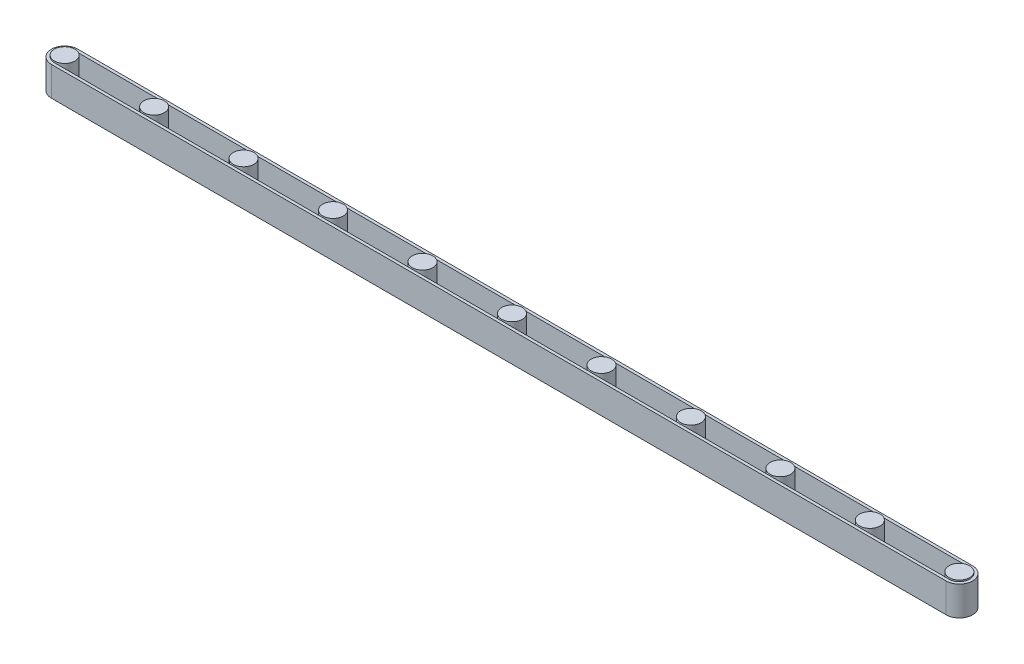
ISO-10303-21;
HEADER;
FILE_DESCRIPTION(('STEP AP214'),'2;1');
FILE_NAME('part.step','',(''),(''),'','','');
FILE_SCHEMA(('AUTOMOTIVE_DESIGN { 1 0 10303 214 1 1 1 1 }'));
ENDSEC;
DATA;
#1=APPLICATION_CONTEXT('core data for automotive mechanical design processes');
#2=APPLICATION_PROTOCOL_DEFINITION('international standard','automotive_design',2000,#1);
#3=PRODUCT_CONTEXT('',#1,'mechanical');
#4=PRODUCT('Part','Part','',(#3));
#5=PRODUCT_RELATED_PRODUCT_CATEGORY('part','',(#4));
#6=PRODUCT_DEFINITION_FORMATION('','',#4);
#7=PRODUCT_DEFINITION_CONTEXT('part definition',#1,'design');
#8=PRODUCT_DEFINITION('design','',#6,#7);
#9=PRODUCT_DEFINITION_SHAPE('','',#8);
#10=(LENGTH_UNIT() NAMED_UNIT(*) SI_UNIT(.MILLI.,.METRE.));
#11=(NAMED_UNIT(*) PLANE_ANGLE_UNIT() SI_UNIT($,.RADIAN.));
#12=(NAMED_UNIT(*) SI_UNIT($,.STERADIAN.) SOLID_ANGLE_UNIT());
#13=UNCERTAINTY_MEASURE_WITH_UNIT(LENGTH_MEASURE(1.E-05),#10,'distance_accuracy_value','');
#14=(GEOMETRIC_REPRESENTATION_CONTEXT(3) GLOBAL_UNCERTAINTY_ASSIGNED_CONTEXT((#13)) GLOBAL_UNIT_ASSIGNED_CONTEXT((#10,
#11,#12)) REPRESENTATION_CONTEXT('',''));
#15=CARTESIAN_POINT('',(0.,0.,0.));
#16=DIRECTION('',(0.,0.,1.));
#17=DIRECTION('',(1.,0.,0.));
#18=AXIS2_PLACEMENT_3D('',#15,#16,#17);
#19=CARTESIAN_POINT('',(0.,50.,0.));
#20=DIRECTION('',(0.,1.,0.));
#21=DIRECTION('',(0.,0.,1.));
#22=AXIS2_PLACEMENT_3D('',#19,#20,#21);
#23=PLANE('',#22);
#24=CARTESIAN_POINT('',(0.,50.,0.));
#25=DIRECTION('',(0.,1.,0.));
#26=DIRECTION('',(0.,0.,1.));
#27=AXIS2_PLACEMENT_3D('',#24,#25,#26);
#28=CIRCLE('',#27,45.);
#29=CARTESIAN_POINT('',(0.,50.,-45.));
#30=VERTEX_POINT('',#29);
#31=CARTESIAN_POINT('',(0.,50.,45.));
#32=VERTEX_POINT('',#31);
#33=EDGE_CURVE('E144',#30,#32,#28,.T.);
#34=ORIENTED_EDGE('',*,*,#33,.T.);
#35=DIRECTION('',(1.,0.,0.));
#36=VECTOR('',#35,1.);
#37=CARTESIAN_POINT('',(0.,50.,45.));
#38=LINE('',#37,#36);
#39=CARTESIAN_POINT('',(3050.,50.,45.0000000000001));
#40=VERTEX_POINT('',#39);
#41=EDGE_CURVE('E147',#32,#40,#38,.T.);
#42=ORIENTED_EDGE('',*,*,#41,.T.);
#43=CARTESIAN_POINT('',(3050.,50.,0.));
#44=DIRECTION('',(0.,1.,0.));
#45=DIRECTION('',(0.,0.,1.));
#46=AXIS2_PLACEMENT_3D('',#43,#44,#45);
#47=CIRCLE('',#46,45.0000000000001);
#48=CARTESIAN_POINT('',(3050.,50.,-45.));
#49=VERTEX_POINT('',#48);
#50=EDGE_CURVE('E150',#40,#49,#47,.T.);
#51=ORIENTED_EDGE('',*,*,#50,.T.);
#52=DIRECTION('',(-1.,0.,0.));
#53=VECTOR('',#52,1.);
#54=CARTESIAN_POINT('',(0.,50.,-45.));
#55=LINE('',#54,#53);
#56=EDGE_CURVE('E152',#49,#30,#55,.T.);
#57=ORIENTED_EDGE('',*,*,#56,.T.);
#58=EDGE_LOOP('',(#34,#42,#51,#57));
#59=FACE_BOUND('',#58,.T.);
#60=DIRECTION('',(1.,0.,0.));
#61=VECTOR('',#60,1.);
#62=CARTESIAN_POINT('',(0.,50.,35.));
#63=LINE('',#62,#61);
#64=CARTESIAN_POINT('',(0.,50.,35.));
#65=VERTEX_POINT('',#64);
#66=CARTESIAN_POINT('',(3050.,50.,35.));
#67=VERTEX_POINT('',#66);
#68=EDGE_CURVE('E116',#65,#67,#63,.T.);
#69=ORIENTED_EDGE('',*,*,#68,.F.);
#70=CARTESIAN_POINT('',(0.,50.,0.));
#71=DIRECTION('',(0.,1.,0.));
#72=DIRECTION('',(0.,0.,1.));
#73=AXIS2_PLACEMENT_3D('',#70,#71,#72);
#74=CIRCLE('',#73,35.);
#75=CARTESIAN_POINT('',(0.,50.,-35.));
#76=VERTEX_POINT('',#75);
#77=EDGE_CURVE('E108',#76,#65,#74,.T.);
#78=ORIENTED_EDGE('',*,*,#77,.F.);
#79=DIRECTION('',(-1.,0.,0.));
#80=VECTOR('',#79,1.);
#81=CARTESIAN_POINT('',(0.,50.,-35.));
#82=LINE('',#81,#80);
#83=CARTESIAN_POINT('',(3050.,50.,-35.));
#84=VERTEX_POINT('',#83);
#85=EDGE_CURVE('E130',#84,#76,#82,.T.);
#86=ORIENTED_EDGE('',*,*,#85,.F.);
#87=CARTESIAN_POINT('',(3050.,50.,0.));
#88=DIRECTION('',(0.,1.,0.));
#89=DIRECTION('',(0.,0.,1.));
#90=AXIS2_PLACEMENT_3D('',#87,#88,#89);
#91=CIRCLE('',#90,35.);
#92=EDGE_CURVE('E128',#67,#84,#91,.T.);
#93=ORIENTED_EDGE('',*,*,#92,.F.);
#94=EDGE_LOOP('',(#69,#78,#86,#93));
#95=FACE_BOUND('',#94,.T.);
#96=ADVANCED_FACE('F43',(#59,#95),#23,.T.);
#97=CARTESIAN_POINT('',(0.,-50.,0.));
#98=DIRECTION('',(0.,1.,0.));
#99=DIRECTION('',(0.,0.,1.));
#100=AXIS2_PLACEMENT_3D('',#97,#98,#99);
#101=PLANE('',#100);
#102=CARTESIAN_POINT('',(0.,-50.,0.));
#103=DIRECTION('',(0.,1.,0.));
#104=DIRECTION('',(0.,0.,1.));
#105=AXIS2_PLACEMENT_3D('',#102,#103,#104);
#106=CIRCLE('',#105,45.);
#107=CARTESIAN_POINT('',(0.,-50.,-45.));
#108=VERTEX_POINT('',#107);
#109=CARTESIAN_POINT('',(0.,-50.,45.));
#110=VERTEX_POINT('',#109);
#111=EDGE_CURVE('E124',#108,#110,#106,.T.);
#112=ORIENTED_EDGE('',*,*,#111,.F.);
#113=DIRECTION('',(-1.,0.,0.));
#114=VECTOR('',#113,1.);
#115=CARTESIAN_POINT('',(0.,-50.,-45.));
#116=LINE('',#115,#114);
#117=CARTESIAN_POINT('',(3050.,-50.,-45.));
#118=VERTEX_POINT('',#117);
#119=EDGE_CURVE('E148',#118,#108,#116,.T.);
#120=ORIENTED_EDGE('',*,*,#119,.F.);
#121=CARTESIAN_POINT('',(3050.,-50.,0.));
#122=DIRECTION('',(0.,1.,0.));
#123=DIRECTION('',(0.,0.,1.));
#124=AXIS2_PLACEMENT_3D('',#121,#122,#123);
#125=CIRCLE('',#124,45.0000000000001);
#126=CARTESIAN_POINT('',(3050.,-50.,45.0000000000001));
#127=VERTEX_POINT('',#126);
#128=EDGE_CURVE('E159',#127,#118,#125,.T.);
#129=ORIENTED_EDGE('',*,*,#128,.F.);
#130=DIRECTION('',(1.,0.,0.));
#131=VECTOR('',#130,1.);
#132=CARTESIAN_POINT('',(0.,-50.,45.));
#133=LINE('',#132,#131);
#134=EDGE_CURVE('E157',#110,#127,#133,.T.);
#135=ORIENTED_EDGE('',*,*,#134,.F.);
#136=EDGE_LOOP('',(#112,#120,#129,#135));
#137=FACE_BOUND('',#136,.T.);
#138=CARTESIAN_POINT('',(0.,-50.,0.));
#139=DIRECTION('',(0.,1.,0.));
#140=DIRECTION('',(0.,0.,1.));
#141=AXIS2_PLACEMENT_3D('',#138,#139,#140);
#142=CIRCLE('',#141,35.);
#143=CARTESIAN_POINT('',(0.,-50.,-35.));
#144=VERTEX_POINT('',#143);
#145=CARTESIAN_POINT('',(0.,-50.,35.));
#146=VERTEX_POINT('',#145);
#147=EDGE_CURVE('E66',#144,#146,#142,.T.);
#148=ORIENTED_EDGE('',*,*,#147,.T.);
#149=DIRECTION('',(1.,0.,0.));
#150=VECTOR('',#149,1.);
#151=CARTESIAN_POINT('',(0.,-50.,35.));
#152=LINE('',#151,#150);
#153=CARTESIAN_POINT('',(3050.,-50.,35.));
#154=VERTEX_POINT('',#153);
#155=EDGE_CURVE('E123',#146,#154,#152,.T.);
#156=ORIENTED_EDGE('',*,*,#155,.T.);
#157=CARTESIAN_POINT('',(3050.,-50.,0.));
#158=DIRECTION('',(0.,1.,0.));
#159=DIRECTION('',(0.,0.,1.));
#160=AXIS2_PLACEMENT_3D('',#157,#158,#159);
#161=CIRCLE('',#160,35.);
#162=CARTESIAN_POINT('',(3050.,-50.,-35.));
#163=VERTEX_POINT('',#162);
#164=EDGE_CURVE('E136',#154,#163,#161,.T.);
#165=ORIENTED_EDGE('',*,*,#164,.T.);
#166=DIRECTION('',(-1.,0.,0.));
#167=VECTOR('',#166,1.);
#168=CARTESIAN_POINT('',(0.,-50.,-35.));
#169=LINE('',#168,#167);
#170=EDGE_CURVE('E117',#163,#144,#169,.T.);
#171=ORIENTED_EDGE('',*,*,#170,.T.);
#172=EDGE_LOOP('',(#148,#156,#165,#171));
#173=FACE_BOUND('',#172,.T.);
#174=ADVANCED_FACE('F177',(#137,#173),#101,.F.);
#175=CARTESIAN_POINT('',(0.,50.,0.));
#176=DIRECTION('',(0.,-1.,0.));
#177=DIRECTION('',(0.,0.,-1.));
#178=AXIS2_PLACEMENT_3D('',#175,#176,#177);
#179=CYLINDRICAL_SURFACE('',#178,45.);
#180=ORIENTED_EDGE('',*,*,#111,.T.);
#181=DIRECTION('',(0.,-1.,0.));
#182=VECTOR('',#181,1.);
#183=CARTESIAN_POINT('',(0.,50.,45.));
#184=LINE('',#183,#182);
#185=EDGE_CURVE('E12',#32,#110,#184,.T.);
#186=ORIENTED_EDGE('',*,*,#185,.F.);
#187=ORIENTED_EDGE('',*,*,#33,.F.);
#188=DIRECTION('',(0.,-1.,0.));
#189=VECTOR('',#188,1.);
#190=CARTESIAN_POINT('',(0.,50.,-45.));
#191=LINE('',#190,#189);
#192=EDGE_CURVE('E154',#30,#108,#191,.T.);
#193=ORIENTED_EDGE('',*,*,#192,.T.);
#194=EDGE_LOOP('',(#180,#186,#187,#193));
#195=FACE_BOUND('',#194,.T.);
#196=ADVANCED_FACE('F45',(#195),#179,.T.);
#197=CARTESIAN_POINT('',(0.,50.,45.));
#198=DIRECTION('',(0.,0.,-1.));
#199=DIRECTION('',(-1.,0.,0.));
#200=AXIS2_PLACEMENT_3D('',#197,#198,#199);
#201=PLANE('',#200);
#202=ORIENTED_EDGE('',*,*,#134,.T.);
#203=DIRECTION('',(0.,-1.,0.));
#204=VECTOR('',#203,1.);
#205=CARTESIAN_POINT('',(3050.,50.,45.0000000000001));
#206=LINE('',#205,#204);
#207=EDGE_CURVE('E51',#40,#127,#206,.T.);
#208=ORIENTED_EDGE('',*,*,#207,.F.);
#209=ORIENTED_EDGE('',*,*,#41,.F.);
#210=ORIENTED_EDGE('',*,*,#185,.T.);
#211=EDGE_LOOP('',(#202,#208,#209,#210));
#212=FACE_BOUND('',#211,.T.);
#213=ADVANCED_FACE('F187',(#212),#201,.F.);
#214=CARTESIAN_POINT('',(3050.,50.,0.));
#215=DIRECTION('',(0.,-1.,0.));
#216=DIRECTION('',(0.,0.,-1.));
#217=AXIS2_PLACEMENT_3D('',#214,#215,#216);
#218=CYLINDRICAL_SURFACE('',#217,45.0000000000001);
#219=ORIENTED_EDGE('',*,*,#128,.T.);
#220=DIRECTION('',(0.,-1.,0.));
#221=VECTOR('',#220,1.);
#222=CARTESIAN_POINT('',(3050.,50.,-45.));
#223=LINE('',#222,#221);
#224=EDGE_CURVE('E164',#49,#118,#223,.T.);
#225=ORIENTED_EDGE('',*,*,#224,.F.);
#226=ORIENTED_EDGE('',*,*,#50,.F.);
#227=ORIENTED_EDGE('',*,*,#207,.T.);
#228=EDGE_LOOP('',(#219,#225,#226,#227));
#229=FACE_BOUND('',#228,.T.);
#230=ADVANCED_FACE('F171',(#229),#218,.T.);
#231=CARTESIAN_POINT('',(0.,50.,-45.));
#232=DIRECTION('',(0.,0.,1.));
#233=DIRECTION('',(1.,0.,0.));
#234=AXIS2_PLACEMENT_3D('',#231,#232,#233);
#235=PLANE('',#234);
#236=ORIENTED_EDGE('',*,*,#119,.T.);
#237=ORIENTED_EDGE('',*,*,#192,.F.);
#238=ORIENTED_EDGE('',*,*,#56,.F.);
#239=ORIENTED_EDGE('',*,*,#224,.T.);
#240=EDGE_LOOP('',(#236,#237,#238,#239));
#241=FACE_BOUND('',#240,.T.);
#242=ADVANCED_FACE('F181',(#241),#235,.F.);
#243=CARTESIAN_POINT('',(0.,50.,0.));
#244=DIRECTION('',(0.,-1.,0.));
#245=DIRECTION('',(0.,0.,-1.));
#246=AXIS2_PLACEMENT_3D('',#243,#244,#245);
#247=CYLINDRICAL_SURFACE('',#246,35.);
#248=ORIENTED_EDGE('',*,*,#147,.F.);
#249=DIRECTION('',(0.,-1.,0.));
#250=VECTOR('',#249,1.);
#251=CARTESIAN_POINT('',(0.,50.,-35.));
#252=LINE('',#251,#250);
#253=EDGE_CURVE('E112',#76,#144,#252,.T.);
#254=ORIENTED_EDGE('',*,*,#253,.F.);
#255=ORIENTED_EDGE('',*,*,#77,.T.);
#256=DIRECTION('',(0.,-1.,0.));
#257=VECTOR('',#256,1.);
#258=CARTESIAN_POINT('',(0.,50.,35.));
#259=LINE('',#258,#257);
#260=EDGE_CURVE('E111',#65,#146,#259,.T.);
#261=ORIENTED_EDGE('',*,*,#260,.T.);
#262=EDGE_LOOP('',(#248,#254,#255,#261));
#263=FACE_BOUND('',#262,.T.);
#264=ADVANCED_FACE('F110',(#263),#247,.F.);
#265=CARTESIAN_POINT('',(0.,50.,35.));
#266=DIRECTION('',(0.,0.,-1.));
#267=DIRECTION('',(-1.,0.,0.));
#268=AXIS2_PLACEMENT_3D('',#265,#266,#267);
#269=PLANE('',#268);
#270=ORIENTED_EDGE('',*,*,#155,.F.);
#271=ORIENTED_EDGE('',*,*,#260,.F.);
#272=ORIENTED_EDGE('',*,*,#68,.T.);
#273=DIRECTION('',(0.,-1.,0.));
#274=VECTOR('',#273,1.);
#275=CARTESIAN_POINT('',(3050.,50.,35.));
#276=LINE('',#275,#274);
#277=EDGE_CURVE('E125',#67,#154,#276,.T.);
#278=ORIENTED_EDGE('',*,*,#277,.T.);
#279=EDGE_LOOP('',(#270,#271,#272,#278));
#280=FACE_BOUND('',#279,.T.);
#281=ADVANCED_FACE('F120',(#280),#269,.T.);
#282=CARTESIAN_POINT('',(3050.,50.,0.));
#283=DIRECTION('',(0.,-1.,0.));
#284=DIRECTION('',(0.,0.,-1.));
#285=AXIS2_PLACEMENT_3D('',#282,#283,#284);
#286=CYLINDRICAL_SURFACE('',#285,35.);
#287=ORIENTED_EDGE('',*,*,#164,.F.);
#288=ORIENTED_EDGE('',*,*,#277,.F.);
#289=ORIENTED_EDGE('',*,*,#92,.T.);
#290=DIRECTION('',(0.,-1.,0.));
#291=VECTOR('',#290,1.);
#292=CARTESIAN_POINT('',(3050.,50.,-35.));
#293=LINE('',#292,#291);
#294=EDGE_CURVE('E58',#84,#163,#293,.T.);
#295=ORIENTED_EDGE('',*,*,#294,.T.);
#296=EDGE_LOOP('',(#287,#288,#289,#295));
#297=FACE_BOUND('',#296,.T.);
#298=ADVANCED_FACE('F210',(#297),#286,.F.);
#299=CARTESIAN_POINT('',(0.,50.,-35.));
#300=DIRECTION('',(0.,0.,1.));
#301=DIRECTION('',(1.,0.,0.));
#302=AXIS2_PLACEMENT_3D('',#299,#300,#301);
#303=PLANE('',#302);
#304=ORIENTED_EDGE('',*,*,#170,.F.);
#305=ORIENTED_EDGE('',*,*,#294,.F.);
#306=ORIENTED_EDGE('',*,*,#85,.T.);
#307=ORIENTED_EDGE('',*,*,#253,.T.);
#308=EDGE_LOOP('',(#304,#305,#306,#307));
#309=FACE_BOUND('',#308,.T.);
#310=ADVANCED_FACE('F214',(#309),#303,.T.);
#311=CLOSED_SHELL('',(#96,#174,#196,#213,#230,#242,#264,#281,#298,#310));
#312=MANIFOLD_SOLID_BREP('B2',#311);
#313=CARTESIAN_POINT('',(2745.,55.,0.));
#314=DIRECTION('',(0.,-1.,0.));
#315=DIRECTION('',(0.,0.,-1.));
#316=AXIS2_PLACEMENT_3D('',#313,#314,#315);
#317=CYLINDRICAL_SURFACE('',#316,35.0000000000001);
#318=CARTESIAN_POINT('',(2745.,55.,0.));
#319=DIRECTION('',(0.,1.,0.));
#320=DIRECTION('',(0.,0.,1.));
#321=AXIS2_PLACEMENT_3D('',#318,#319,#320);
#322=CIRCLE('',#321,35.0000000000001);
#323=CARTESIAN_POINT('',(2745.,55.,35.0000000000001));
#324=VERTEX_POINT('',#323);
#325=EDGE_CURVE('E42',#324,#324,#322,.T.);
#326=ORIENTED_EDGE('',*,*,#325,.F.);
#327=EDGE_LOOP('',(#326));
#328=FACE_BOUND('',#327,.T.);
#329=CARTESIAN_POINT('',(2745.,-55.,0.));
#330=DIRECTION('',(0.,1.,0.));
#331=DIRECTION('',(0.,0.,1.));
#332=AXIS2_PLACEMENT_3D('',#329,#330,#331);
#333=CIRCLE('',#332,35.0000000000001);
#334=CARTESIAN_POINT('',(2745.,-55.,35.0000000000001));
#335=VERTEX_POINT('',#334);
#336=EDGE_CURVE('E283',#335,#335,#333,.T.);
#337=ORIENTED_EDGE('',*,*,#336,.T.);
#338=EDGE_LOOP('',(#337));
#339=FACE_BOUND('',#338,.T.);
#340=ADVANCED_FACE('F280',(#328,#339),#317,.T.);
#341=CARTESIAN_POINT('',(2745.,55.,0.));
#342=DIRECTION('',(0.,1.,0.));
#343=DIRECTION('',(0.,0.,1.));
#344=AXIS2_PLACEMENT_3D('',#341,#342,#343);
#345=PLANE('',#344);
#346=ORIENTED_EDGE('',*,*,#325,.T.);
#347=EDGE_LOOP('',(#346));
#348=FACE_BOUND('',#347,.T.);
#349=ADVANCED_FACE('F295',(#348),#345,.T.);
#350=CARTESIAN_POINT('',(2745.,-55.,0.));
#351=DIRECTION('',(0.,1.,0.));
#352=DIRECTION('',(0.,0.,1.));
#353=AXIS2_PLACEMENT_3D('',#350,#351,#352);
#354=PLANE('',#353);
#355=ORIENTED_EDGE('',*,*,#336,.F.);
#356=EDGE_LOOP('',(#355));
#357=FACE_BOUND('',#356,.T.);
#358=ADVANCED_FACE('F293',(#357),#354,.F.);
#359=CLOSED_SHELL('',(#340,#349,#358));
#360=MANIFOLD_SOLID_BREP('B6',#359);
#361=CARTESIAN_POINT('',(2440.,55.,0.));
#362=DIRECTION('',(0.,-1.,0.));
#363=DIRECTION('',(0.,0.,-1.));
#364=AXIS2_PLACEMENT_3D('',#361,#362,#363);
#365=CYLINDRICAL_SURFACE('',#364,35.0000000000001);
#366=CARTESIAN_POINT('',(2440.,55.,0.));
#367=DIRECTION('',(0.,1.,0.));
#368=DIRECTION('',(0.,0.,1.));
#369=AXIS2_PLACEMENT_3D('',#366,#367,#368);
#370=CIRCLE('',#369,35.0000000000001);
#371=CARTESIAN_POINT('',(2440.,55.,35.0000000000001));
#372=VERTEX_POINT('',#371);
#373=EDGE_CURVE('E279',#372,#372,#370,.T.);
#374=ORIENTED_EDGE('',*,*,#373,.F.);
#375=EDGE_LOOP('',(#374));
#376=FACE_BOUND('',#375,.T.);
#377=CARTESIAN_POINT('',(2440.,-55.,0.));
#378=DIRECTION('',(0.,1.,0.));
#379=DIRECTION('',(0.,0.,1.));
#380=AXIS2_PLACEMENT_3D('',#377,#378,#379);
#381=CIRCLE('',#380,35.0000000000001);
#382=CARTESIAN_POINT('',(2440.,-55.,35.0000000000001));
#383=VERTEX_POINT('',#382);
#384=EDGE_CURVE('E331',#383,#383,#381,.T.);
#385=ORIENTED_EDGE('',*,*,#384,.T.);
#386=EDGE_LOOP('',(#385));
#387=FACE_BOUND('',#386,.T.);
#388=ADVANCED_FACE('F328',(#376,#387),#365,.T.);
#389=CARTESIAN_POINT('',(2440.,55.,0.));
#390=DIRECTION('',(0.,1.,0.));
#391=DIRECTION('',(0.,0.,1.));
#392=AXIS2_PLACEMENT_3D('',#389,#390,#391);
#393=PLANE('',#392);
#394=ORIENTED_EDGE('',*,*,#373,.T.);
#395=EDGE_LOOP('',(#394));
#396=FACE_BOUND('',#395,.T.);
#397=ADVANCED_FACE('F343',(#396),#393,.T.);
#398=CARTESIAN_POINT('',(2440.,-55.,0.));
#399=DIRECTION('',(0.,1.,0.));
#400=DIRECTION('',(0.,0.,1.));
#401=AXIS2_PLACEMENT_3D('',#398,#399,#400);
#402=PLANE('',#401);
#403=ORIENTED_EDGE('',*,*,#384,.F.);
#404=EDGE_LOOP('',(#403));
#405=FACE_BOUND('',#404,.T.);
#406=ADVANCED_FACE('F341',(#405),#402,.F.);
#407=CLOSED_SHELL('',(#388,#397,#406));
#408=MANIFOLD_SOLID_BREP('B37',#407);
#409=CARTESIAN_POINT('',(2135.,55.,0.));
#410=DIRECTION('',(0.,-1.,0.));
#411=DIRECTION('',(0.,0.,-1.));
#412=AXIS2_PLACEMENT_3D('',#409,#410,#411);
#413=CYLINDRICAL_SURFACE('',#412,35.0000000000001);
#414=CARTESIAN_POINT('',(2135.,55.,0.));
#415=DIRECTION('',(0.,1.,0.));
#416=DIRECTION('',(0.,0.,1.));
#417=AXIS2_PLACEMENT_3D('',#414,#415,#416);
#418=CIRCLE('',#417,35.0000000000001);
#419=CARTESIAN_POINT('',(2135.,55.,35.0000000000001));
#420=VERTEX_POINT('',#419);
#421=EDGE_CURVE('E327',#420,#420,#418,.T.);
#422=ORIENTED_EDGE('',*,*,#421,.F.);
#423=EDGE_LOOP('',(#422));
#424=FACE_BOUND('',#423,.T.);
#425=CARTESIAN_POINT('',(2135.,-55.,0.));
#426=DIRECTION('',(0.,1.,0.));
#427=DIRECTION('',(0.,0.,1.));
#428=AXIS2_PLACEMENT_3D('',#425,#426,#427);
#429=CIRCLE('',#428,35.0000000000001);
#430=CARTESIAN_POINT('',(2135.,-55.,35.0000000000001));
#431=VERTEX_POINT('',#430);
#432=EDGE_CURVE('E379',#431,#431,#429,.T.);
#433=ORIENTED_EDGE('',*,*,#432,.T.);
#434=EDGE_LOOP('',(#433));
#435=FACE_BOUND('',#434,.T.);
#436=ADVANCED_FACE('F376',(#424,#435),#413,.T.);
#437=CARTESIAN_POINT('',(2135.,55.,0.));
#438=DIRECTION('',(0.,1.,0.));
#439=DIRECTION('',(0.,0.,1.));
#440=AXIS2_PLACEMENT_3D('',#437,#438,#439);
#441=PLANE('',#440);
#442=ORIENTED_EDGE('',*,*,#421,.T.);
#443=EDGE_LOOP('',(#442));
#444=FACE_BOUND('',#443,.T.);
#445=ADVANCED_FACE('F391',(#444),#441,.T.);
#446=CARTESIAN_POINT('',(2135.,-55.,0.));
#447=DIRECTION('',(0.,1.,0.));
#448=DIRECTION('',(0.,0.,1.));
#449=AXIS2_PLACEMENT_3D('',#446,#447,#448);
#450=PLANE('',#449);
#451=ORIENTED_EDGE('',*,*,#432,.F.);
#452=EDGE_LOOP('',(#451));
#453=FACE_BOUND('',#452,.T.);
#454=ADVANCED_FACE('F389',(#453),#450,.F.);
#455=CLOSED_SHELL('',(#436,#445,#454));
#456=MANIFOLD_SOLID_BREP('B274',#455);
#457=CARTESIAN_POINT('',(1525.,55.,0.));
#458=DIRECTION('',(0.,-1.,0.));
#459=DIRECTION('',(0.,0.,-1.));
#460=AXIS2_PLACEMENT_3D('',#457,#458,#459);
#461=CYLINDRICAL_SURFACE('',#460,34.9999999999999);
#462=CARTESIAN_POINT('',(1525.,55.,0.));
#463=DIRECTION('',(0.,1.,0.));
#464=DIRECTION('',(0.,0.,1.));
#465=AXIS2_PLACEMENT_3D('',#462,#463,#464);
#466=CIRCLE('',#465,34.9999999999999);
#467=CARTESIAN_POINT('',(1525.,55.,34.9999999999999));
#468=VERTEX_POINT('',#467);
#469=EDGE_CURVE('E375',#468,#468,#466,.T.);
#470=ORIENTED_EDGE('',*,*,#469,.F.);
#471=EDGE_LOOP('',(#470));
#472=FACE_BOUND('',#471,.T.);
#473=CARTESIAN_POINT('',(1525.,-55.,0.));
#474=DIRECTION('',(0.,1.,0.));
#475=DIRECTION('',(0.,0.,1.));
#476=AXIS2_PLACEMENT_3D('',#473,#474,#475);
#477=CIRCLE('',#476,34.9999999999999);
#478=CARTESIAN_POINT('',(1525.,-55.,34.9999999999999));
#479=VERTEX_POINT('',#478);
#480=EDGE_CURVE('E427',#479,#479,#477,.T.);
#481=ORIENTED_EDGE('',*,*,#480,.T.);
#482=EDGE_LOOP('',(#481));
#483=FACE_BOUND('',#482,.T.);
#484=ADVANCED_FACE('F424',(#472,#483),#461,.T.);
#485=CARTESIAN_POINT('',(1525.,55.,0.));
#486=DIRECTION('',(0.,1.,0.));
#487=DIRECTION('',(0.,0.,1.));
#488=AXIS2_PLACEMENT_3D('',#485,#486,#487);
#489=PLANE('',#488);
#490=ORIENTED_EDGE('',*,*,#469,.T.);
#491=EDGE_LOOP('',(#490));
#492=FACE_BOUND('',#491,.T.);
#493=ADVANCED_FACE('F439',(#492),#489,.T.);
#494=CARTESIAN_POINT('',(1525.,-55.,0.));
#495=DIRECTION('',(0.,1.,0.));
#496=DIRECTION('',(0.,0.,1.));
#497=AXIS2_PLACEMENT_3D('',#494,#495,#496);
#498=PLANE('',#497);
#499=ORIENTED_EDGE('',*,*,#480,.F.);
#500=EDGE_LOOP('',(#499));
#501=FACE_BOUND('',#500,.T.);
#502=ADVANCED_FACE('F437',(#501),#498,.F.);
#503=CLOSED_SHELL('',(#484,#493,#502));
#504=MANIFOLD_SOLID_BREP('B322',#503);
#505=CARTESIAN_POINT('',(1830.,55.,0.));
#506=DIRECTION('',(0.,-1.,0.));
#507=DIRECTION('',(0.,0.,-1.));
#508=AXIS2_PLACEMENT_3D('',#505,#506,#507);
#509=CYLINDRICAL_SURFACE('',#508,35.0000000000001);
#510=CARTESIAN_POINT('',(1830.,55.,0.));
#511=DIRECTION('',(0.,1.,0.));
#512=DIRECTION('',(0.,0.,1.));
#513=AXIS2_PLACEMENT_3D('',#510,#511,#512);
#514=CIRCLE('',#513,35.0000000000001);
#515=CARTESIAN_POINT('',(1830.,55.,35.0000000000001));
#516=VERTEX_POINT('',#515);
#517=EDGE_CURVE('E423',#516,#516,#514,.T.);
#518=ORIENTED_EDGE('',*,*,#517,.F.);
#519=EDGE_LOOP('',(#518));
#520=FACE_BOUND('',#519,.T.);
#521=CARTESIAN_POINT('',(1830.,-55.,0.));
#522=DIRECTION('',(0.,1.,0.));
#523=DIRECTION('',(0.,0.,1.));
#524=AXIS2_PLACEMENT_3D('',#521,#522,#523);
#525=CIRCLE('',#524,35.0000000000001);
#526=CARTESIAN_POINT('',(1830.,-55.,35.0000000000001));
#527=VERTEX_POINT('',#526);
#528=EDGE_CURVE('E475',#527,#527,#525,.T.);
#529=ORIENTED_EDGE('',*,*,#528,.T.);
#530=EDGE_LOOP('',(#529));
#531=FACE_BOUND('',#530,.T.);
#532=ADVANCED_FACE('F472',(#520,#531),#509,.T.);
#533=CARTESIAN_POINT('',(1830.,55.,0.));
#534=DIRECTION('',(0.,1.,0.));
#535=DIRECTION('',(0.,0.,1.));
#536=AXIS2_PLACEMENT_3D('',#533,#534,#535);
#537=PLANE('',#536);
#538=ORIENTED_EDGE('',*,*,#517,.T.);
#539=EDGE_LOOP('',(#538));
#540=FACE_BOUND('',#539,.T.);
#541=ADVANCED_FACE('F487',(#540),#537,.T.);
#542=CARTESIAN_POINT('',(1830.,-55.,0.));
#543=DIRECTION('',(0.,1.,0.));
#544=DIRECTION('',(0.,0.,1.));
#545=AXIS2_PLACEMENT_3D('',#542,#543,#544);
#546=PLANE('',#545);
#547=ORIENTED_EDGE('',*,*,#528,.F.);
#548=EDGE_LOOP('',(#547));
#549=FACE_BOUND('',#548,.T.);
#550=ADVANCED_FACE('F485',(#549),#546,.F.);
#551=CLOSED_SHELL('',(#532,#541,#550));
#552=MANIFOLD_SOLID_BREP('B370',#551);
#553=CARTESIAN_POINT('',(1220.,55.,0.));
#554=DIRECTION('',(0.,-1.,0.));
#555=DIRECTION('',(0.,0.,-1.));
#556=AXIS2_PLACEMENT_3D('',#553,#554,#555);
#557=CYLINDRICAL_SURFACE('',#556,34.9999999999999);
#558=CARTESIAN_POINT('',(1220.,55.,0.));
#559=DIRECTION('',(0.,1.,0.));
#560=DIRECTION('',(0.,0.,1.));
#561=AXIS2_PLACEMENT_3D('',#558,#559,#560);
#562=CIRCLE('',#561,34.9999999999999);
#563=CARTESIAN_POINT('',(1220.,55.,34.9999999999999));
#564=VERTEX_POINT('',#563);
#565=EDGE_CURVE('E471',#564,#564,#562,.T.);
#566=ORIENTED_EDGE('',*,*,#565,.F.);
#567=EDGE_LOOP('',(#566));
#568=FACE_BOUND('',#567,.T.);
#569=CARTESIAN_POINT('',(1220.,-55.,0.));
#570=DIRECTION('',(0.,1.,0.));
#571=DIRECTION('',(0.,0.,1.));
#572=AXIS2_PLACEMENT_3D('',#569,#570,#571);
#573=CIRCLE('',#572,34.9999999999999);
#574=CARTESIAN_POINT('',(1220.,-55.,34.9999999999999));
#575=VERTEX_POINT('',#574);
#576=EDGE_CURVE('E523',#575,#575,#573,.T.);
#577=ORIENTED_EDGE('',*,*,#576,.T.);
#578=EDGE_LOOP('',(#577));
#579=FACE_BOUND('',#578,.T.);
#580=ADVANCED_FACE('F520',(#568,#579),#557,.T.);
#581=CARTESIAN_POINT('',(1220.,55.,0.));
#582=DIRECTION('',(0.,1.,0.));
#583=DIRECTION('',(0.,0.,1.));
#584=AXIS2_PLACEMENT_3D('',#581,#582,#583);
#585=PLANE('',#584);
#586=ORIENTED_EDGE('',*,*,#565,.T.);
#587=EDGE_LOOP('',(#586));
#588=FACE_BOUND('',#587,.T.);
#589=ADVANCED_FACE('F535',(#588),#585,.T.);
#590=CARTESIAN_POINT('',(1220.,-55.,0.));
#591=DIRECTION('',(0.,1.,0.));
#592=DIRECTION('',(0.,0.,1.));
#593=AXIS2_PLACEMENT_3D('',#590,#591,#592);
#594=PLANE('',#593);
#595=ORIENTED_EDGE('',*,*,#576,.F.);
#596=EDGE_LOOP('',(#595));
#597=FACE_BOUND('',#596,.T.);
#598=ADVANCED_FACE('F533',(#597),#594,.F.);
#599=CLOSED_SHELL('',(#580,#589,#598));
#600=MANIFOLD_SOLID_BREP('B418',#599);
#601=CARTESIAN_POINT('',(915.,55.,0.));
#602=DIRECTION('',(0.,-1.,0.));
#603=DIRECTION('',(0.,0.,-1.));
#604=AXIS2_PLACEMENT_3D('',#601,#602,#603);
#605=CYLINDRICAL_SURFACE('',#604,34.9999999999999);
#606=CARTESIAN_POINT('',(915.,55.,0.));
#607=DIRECTION('',(0.,1.,0.));
#608=DIRECTION('',(0.,0.,1.));
#609=AXIS2_PLACEMENT_3D('',#606,#607,#608);
#610=CIRCLE('',#609,34.9999999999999);
#611=CARTESIAN_POINT('',(915.,55.,34.9999999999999));
#612=VERTEX_POINT('',#611);
#613=EDGE_CURVE('E519',#612,#612,#610,.T.);
#614=ORIENTED_EDGE('',*,*,#613,.F.);
#615=EDGE_LOOP('',(#614));
#616=FACE_BOUND('',#615,.T.);
#617=CARTESIAN_POINT('',(915.,-55.,0.));
#618=DIRECTION('',(0.,1.,0.));
#619=DIRECTION('',(0.,0.,1.));
#620=AXIS2_PLACEMENT_3D('',#617,#618,#619);
#621=CIRCLE('',#620,34.9999999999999);
#622=CARTESIAN_POINT('',(915.,-55.,34.9999999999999));
#623=VERTEX_POINT('',#622);
#624=EDGE_CURVE('E571',#623,#623,#621,.T.);
#625=ORIENTED_EDGE('',*,*,#624,.T.);
#626=EDGE_LOOP('',(#625));
#627=FACE_BOUND('',#626,.T.);
#628=ADVANCED_FACE('F568',(#616,#627),#605,.T.);
#629=CARTESIAN_POINT('',(915.,55.,0.));
#630=DIRECTION('',(0.,1.,0.));
#631=DIRECTION('',(0.,0.,1.));
#632=AXIS2_PLACEMENT_3D('',#629,#630,#631);
#633=PLANE('',#632);
#634=ORIENTED_EDGE('',*,*,#613,.T.);
#635=EDGE_LOOP('',(#634));
#636=FACE_BOUND('',#635,.T.);
#637=ADVANCED_FACE('F583',(#636),#633,.T.);
#638=CARTESIAN_POINT('',(915.,-55.,0.));
#639=DIRECTION('',(0.,1.,0.));
#640=DIRECTION('',(0.,0.,1.));
#641=AXIS2_PLACEMENT_3D('',#638,#639,#640);
#642=PLANE('',#641);
#643=ORIENTED_EDGE('',*,*,#624,.F.);
#644=EDGE_LOOP('',(#643));
#645=FACE_BOUND('',#644,.T.);
#646=ADVANCED_FACE('F581',(#645),#642,.F.);
#647=CLOSED_SHELL('',(#628,#637,#646));
#648=MANIFOLD_SOLID_BREP('B466',#647);
#649=CARTESIAN_POINT('',(610.,55.,0.));
#650=DIRECTION('',(0.,-1.,0.));
#651=DIRECTION('',(0.,0.,-1.));
#652=AXIS2_PLACEMENT_3D('',#649,#650,#651);
#653=CYLINDRICAL_SURFACE('',#652,35.);
#654=CARTESIAN_POINT('',(610.,55.,0.));
#655=DIRECTION('',(0.,1.,0.));
#656=DIRECTION('',(0.,0.,1.));
#657=AXIS2_PLACEMENT_3D('',#654,#655,#656);
#658=CIRCLE('',#657,35.);
#659=CARTESIAN_POINT('',(610.,55.,35.));
#660=VERTEX_POINT('',#659);
#661=EDGE_CURVE('E567',#660,#660,#658,.T.);
#662=ORIENTED_EDGE('',*,*,#661,.F.);
#663=EDGE_LOOP('',(#662));
#664=FACE_BOUND('',#663,.T.);
#665=CARTESIAN_POINT('',(610.,-55.,0.));
#666=DIRECTION('',(0.,1.,0.));
#667=DIRECTION('',(0.,0.,1.));
#668=AXIS2_PLACEMENT_3D('',#665,#666,#667);
#669=CIRCLE('',#668,35.);
#670=CARTESIAN_POINT('',(610.,-55.,35.));
#671=VERTEX_POINT('',#670);
#672=EDGE_CURVE('E619',#671,#671,#669,.T.);
#673=ORIENTED_EDGE('',*,*,#672,.T.);
#674=EDGE_LOOP('',(#673));
#675=FACE_BOUND('',#674,.T.);
#676=ADVANCED_FACE('F616',(#664,#675),#653,.T.);
#677=CARTESIAN_POINT('',(610.,55.,0.));
#678=DIRECTION('',(0.,1.,0.));
#679=DIRECTION('',(0.,0.,1.));
#680=AXIS2_PLACEMENT_3D('',#677,#678,#679);
#681=PLANE('',#680);
#682=ORIENTED_EDGE('',*,*,#661,.T.);
#683=EDGE_LOOP('',(#682));
#684=FACE_BOUND('',#683,.T.);
#685=ADVANCED_FACE('F631',(#684),#681,.T.);
#686=CARTESIAN_POINT('',(610.,-55.,0.));
#687=DIRECTION('',(0.,1.,0.));
#688=DIRECTION('',(0.,0.,1.));
#689=AXIS2_PLACEMENT_3D('',#686,#687,#688);
#690=PLANE('',#689);
#691=ORIENTED_EDGE('',*,*,#672,.F.);
#692=EDGE_LOOP('',(#691));
#693=FACE_BOUND('',#692,.T.);
#694=ADVANCED_FACE('F629',(#693),#690,.F.);
#695=CLOSED_SHELL('',(#676,#685,#694));
#696=MANIFOLD_SOLID_BREP('B514',#695);
#697=CARTESIAN_POINT('',(305.,55.,0.));
#698=DIRECTION('',(0.,-1.,0.));
#699=DIRECTION('',(0.,0.,-1.));
#700=AXIS2_PLACEMENT_3D('',#697,#698,#699);
#701=CYLINDRICAL_SURFACE('',#700,35.);
#702=CARTESIAN_POINT('',(305.,55.,0.));
#703=DIRECTION('',(0.,1.,0.));
#704=DIRECTION('',(0.,0.,1.));
#705=AXIS2_PLACEMENT_3D('',#702,#703,#704);
#706=CIRCLE('',#705,35.);
#707=CARTESIAN_POINT('',(305.,55.,35.));
#708=VERTEX_POINT('',#707);
#709=EDGE_CURVE('E615',#708,#708,#706,.T.);
#710=ORIENTED_EDGE('',*,*,#709,.F.);
#711=EDGE_LOOP('',(#710));
#712=FACE_BOUND('',#711,.T.);
#713=CARTESIAN_POINT('',(305.,-55.,0.));
#714=DIRECTION('',(0.,1.,0.));
#715=DIRECTION('',(0.,0.,1.));
#716=AXIS2_PLACEMENT_3D('',#713,#714,#715);
#717=CIRCLE('',#716,35.);
#718=CARTESIAN_POINT('',(305.,-55.,35.));
#719=VERTEX_POINT('',#718);
#720=EDGE_CURVE('E667',#719,#719,#717,.T.);
#721=ORIENTED_EDGE('',*,*,#720,.T.);
#722=EDGE_LOOP('',(#721));
#723=FACE_BOUND('',#722,.T.);
#724=ADVANCED_FACE('F664',(#712,#723),#701,.T.);
#725=CARTESIAN_POINT('',(305.,55.,0.));
#726=DIRECTION('',(0.,1.,0.));
#727=DIRECTION('',(0.,0.,1.));
#728=AXIS2_PLACEMENT_3D('',#725,#726,#727);
#729=PLANE('',#728);
#730=ORIENTED_EDGE('',*,*,#709,.T.);
#731=EDGE_LOOP('',(#730));
#732=FACE_BOUND('',#731,.T.);
#733=ADVANCED_FACE('F679',(#732),#729,.T.);
#734=CARTESIAN_POINT('',(305.,-55.,0.));
#735=DIRECTION('',(0.,1.,0.));
#736=DIRECTION('',(0.,0.,1.));
#737=AXIS2_PLACEMENT_3D('',#734,#735,#736);
#738=PLANE('',#737);
#739=ORIENTED_EDGE('',*,*,#720,.F.);
#740=EDGE_LOOP('',(#739));
#741=FACE_BOUND('',#740,.T.);
#742=ADVANCED_FACE('F677',(#741),#738,.F.);
#743=CLOSED_SHELL('',(#724,#733,#742));
#744=MANIFOLD_SOLID_BREP('B562',#743);
#745=CARTESIAN_POINT('',(3050.,55.,0.));
#746=DIRECTION('',(0.,-1.,0.));
#747=DIRECTION('',(0.,0.,-1.));
#748=AXIS2_PLACEMENT_3D('',#745,#746,#747);
#749=CYLINDRICAL_SURFACE('',#748,35.0000000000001);
#750=CARTESIAN_POINT('',(3050.,55.,0.));
#751=DIRECTION('',(0.,1.,0.));
#752=DIRECTION('',(0.,0.,1.));
#753=AXIS2_PLACEMENT_3D('',#750,#751,#752);
#754=CIRCLE('',#753,35.0000000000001);
#755=CARTESIAN_POINT('',(3050.,55.,35.0000000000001));
#756=VERTEX_POINT('',#755);
#757=EDGE_CURVE('E663',#756,#756,#754,.T.);
#758=ORIENTED_EDGE('',*,*,#757,.F.);
#759=EDGE_LOOP('',(#758));
#760=FACE_BOUND('',#759,.T.);
#761=CARTESIAN_POINT('',(3050.,-55.,0.));
#762=DIRECTION('',(0.,1.,0.));
#763=DIRECTION('',(0.,0.,1.));
#764=AXIS2_PLACEMENT_3D('',#761,#762,#763);
#765=CIRCLE('',#764,35.0000000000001);
#766=CARTESIAN_POINT('',(3050.,-55.,35.0000000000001));
#767=VERTEX_POINT('',#766);
#768=EDGE_CURVE('E714',#767,#767,#765,.T.);
#769=ORIENTED_EDGE('',*,*,#768,.T.);
#770=EDGE_LOOP('',(#769));
#771=FACE_BOUND('',#770,.T.);
#772=ADVANCED_FACE('F711',(#760,#771),#749,.T.);
#773=CARTESIAN_POINT('',(3050.,55.,0.));
#774=DIRECTION('',(0.,1.,0.));
#775=DIRECTION('',(0.,0.,1.));
#776=AXIS2_PLACEMENT_3D('',#773,#774,#775);
#777=PLANE('',#776);
#778=ORIENTED_EDGE('',*,*,#757,.T.);
#779=EDGE_LOOP('',(#778));
#780=FACE_BOUND('',#779,.T.);
#781=ADVANCED_FACE('F726',(#780),#777,.T.);
#782=CARTESIAN_POINT('',(3050.,-55.,0.));
#783=DIRECTION('',(0.,1.,0.));
#784=DIRECTION('',(0.,0.,1.));
#785=AXIS2_PLACEMENT_3D('',#782,#783,#784);
#786=PLANE('',#785);
#787=ORIENTED_EDGE('',*,*,#768,.F.);
#788=EDGE_LOOP('',(#787));
#789=FACE_BOUND('',#788,.T.);
#790=ADVANCED_FACE('F724',(#789),#786,.F.);
#791=CLOSED_SHELL('',(#772,#781,#790));
#792=MANIFOLD_SOLID_BREP('B610',#791);
#793=CARTESIAN_POINT('',(0.,55.,0.));
#794=DIRECTION('',(0.,-1.,0.));
#795=DIRECTION('',(0.,0.,-1.));
#796=AXIS2_PLACEMENT_3D('',#793,#794,#795);
#797=CYLINDRICAL_SURFACE('',#796,35.);
#798=CARTESIAN_POINT('',(0.,55.,0.));
#799=DIRECTION('',(0.,1.,0.));
#800=DIRECTION('',(0.,0.,1.));
#801=AXIS2_PLACEMENT_3D('',#798,#799,#800);
#802=CIRCLE('',#801,35.);
#803=CARTESIAN_POINT('',(0.,55.,35.));
#804=VERTEX_POINT('',#803);
#805=EDGE_CURVE('E710',#804,#804,#802,.T.);
#806=ORIENTED_EDGE('',*,*,#805,.F.);
#807=EDGE_LOOP('',(#806));
#808=FACE_BOUND('',#807,.T.);
#809=CARTESIAN_POINT('',(0.,-55.,0.));
#810=DIRECTION('',(0.,1.,0.));
#811=DIRECTION('',(0.,0.,1.));
#812=AXIS2_PLACEMENT_3D('',#809,#810,#811);
#813=CIRCLE('',#812,35.);
#814=CARTESIAN_POINT('',(0.,-55.,35.));
#815=VERTEX_POINT('',#814);
#816=EDGE_CURVE('E754',#815,#815,#813,.T.);
#817=ORIENTED_EDGE('',*,*,#816,.T.);
#818=EDGE_LOOP('',(#817));
#819=FACE_BOUND('',#818,.T.);
#820=ADVANCED_FACE('F751',(#808,#819),#797,.T.);
#821=CARTESIAN_POINT('',(0.,55.,0.));
#822=DIRECTION('',(0.,1.,0.));
#823=DIRECTION('',(0.,0.,1.));
#824=AXIS2_PLACEMENT_3D('',#821,#822,#823);
#825=PLANE('',#824);
#826=ORIENTED_EDGE('',*,*,#805,.T.);
#827=EDGE_LOOP('',(#826));
#828=FACE_BOUND('',#827,.T.);
#829=ADVANCED_FACE('F766',(#828),#825,.T.);
#830=CARTESIAN_POINT('',(0.,-55.,0.));
#831=DIRECTION('',(0.,1.,0.));
#832=DIRECTION('',(0.,0.,1.));
#833=AXIS2_PLACEMENT_3D('',#830,#831,#832);
#834=PLANE('',#833);
#835=ORIENTED_EDGE('',*,*,#816,.F.);
#836=EDGE_LOOP('',(#835));
#837=FACE_BOUND('',#836,.T.);
#838=ADVANCED_FACE('F764',(#837),#834,.F.);
#839=CLOSED_SHELL('',(#820,#829,#838));
#840=MANIFOLD_SOLID_BREP('B658',#839);
#841=ADVANCED_BREP_SHAPE_REPRESENTATION('',(#18,#312,#360,#408,#456,#504,#552,#600,#648,#696,
#744,#792,#840),#14);
#842=SHAPE_DEFINITION_REPRESENTATION(#9,#841);
ENDSEC;
END-ISO-10303-21;
